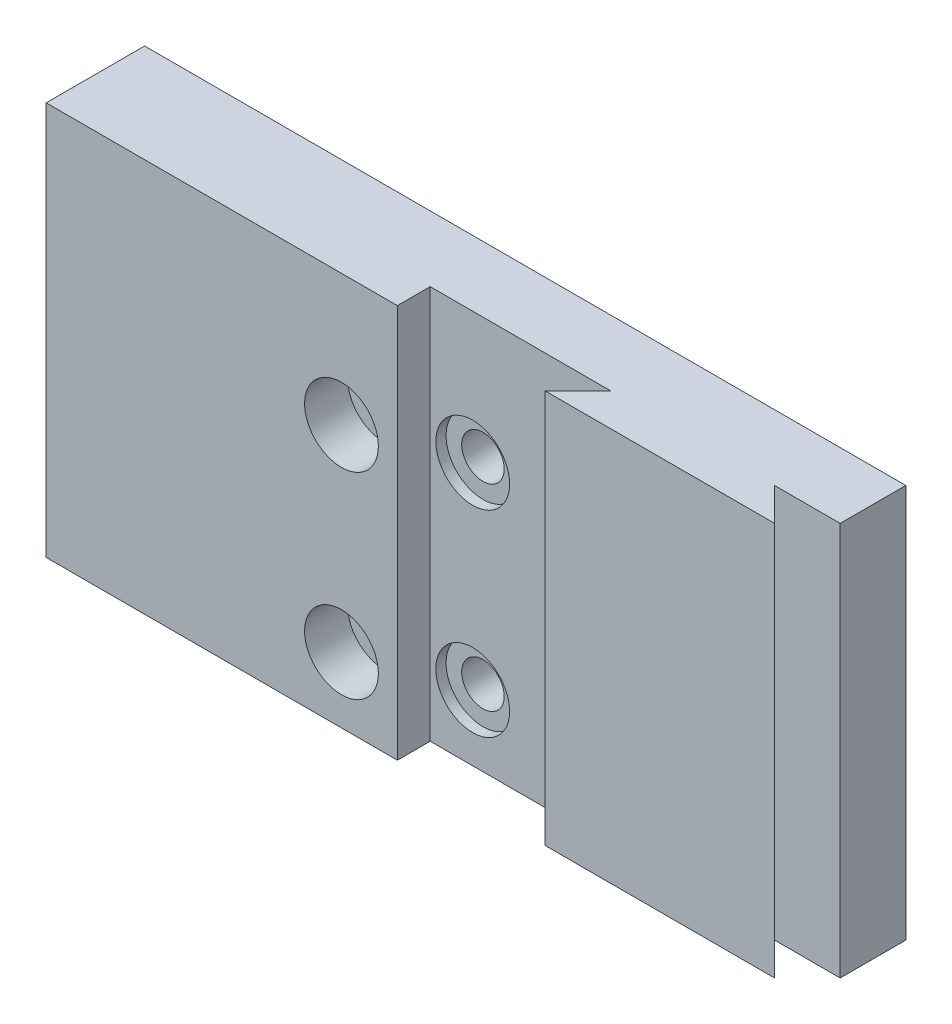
from build123d import *

# Parameters (mm, degrees)
SKETCH1_W                                      = 73.66
SKETCH1_H                                      = 38.1
BOSS_EXTRUDE1_DEPTH                            = 9.525
SKETCH2_R                                      = 2.0574
CUT_EXTRUDE1_DEPTH                             = 15.24
CUT_EXTRUDE2_DEPTH                             = 45.72
CBORE_FOR_8_SOCKET_HEAD_CAP_SCREW1_D           = 4.1148
CBORE_FOR_8_SOCKET_HEAD_CAP_SCREW1_CBORE_D     = 7.1374
CBORE_FOR_8_SOCKET_HEAD_CAP_SCREW1_CBORE_DEPTH = 4.1656


with BuildPart() as part:
    # Sketch1 → Boss-Extrude1 (new body)
    with BuildSketch(Plane.XY):
        with Locations((36.83, 19.05)):
            Rectangle(SKETCH1_W, SKETCH1_H)
    extrude(amount=BOSS_EXTRUDE1_DEPTH)

    # Sketch2 → Cut-Extrude1 (cut)
    with BuildSketch(Plane.ZY):
        with Locations((4.7498, 6.35)):
            Circle(SKETCH2_R)
        with Locations((4.7498, 25.4)):
            Circle(SKETCH2_R)
    extrude(amount=-CUT_EXTRUDE1_DEPTH, mode=Mode.SUBTRACT)

    # Sketch3 → Cut-Extrude2 (cut)
    with BuildSketch(Plane.XZ):
        Polygon((73.66, 6.35), (67.31, 6.35), (70.485, 9.525), (48.26, 9.525), (51.435, 6.35), (33.9852, 6.35), (33.9852, 9.525), (33.9852, 11.43), (73.66, 11.43), (73.66, 9.525), align=None)
    extrude(amount=-CUT_EXTRUDE2_DEPTH, mode=Mode.SUBTRACT)

    # CBORE for _8 Socket Head Cap Screw1 (through all)
    with Locations(Plane.XY.offset(9.525)):
        with Locations((28.575, 25.4), (28.575, 6.35), (38.1, 25.4), (38.1, 6.35)):
            CounterBoreHole(CBORE_FOR_8_SOCKET_HEAD_CAP_SCREW1_D / 2, CBORE_FOR_8_SOCKET_HEAD_CAP_SCREW1_CBORE_D / 2, CBORE_FOR_8_SOCKET_HEAD_CAP_SCREW1_CBORE_DEPTH)


solid = part.part
